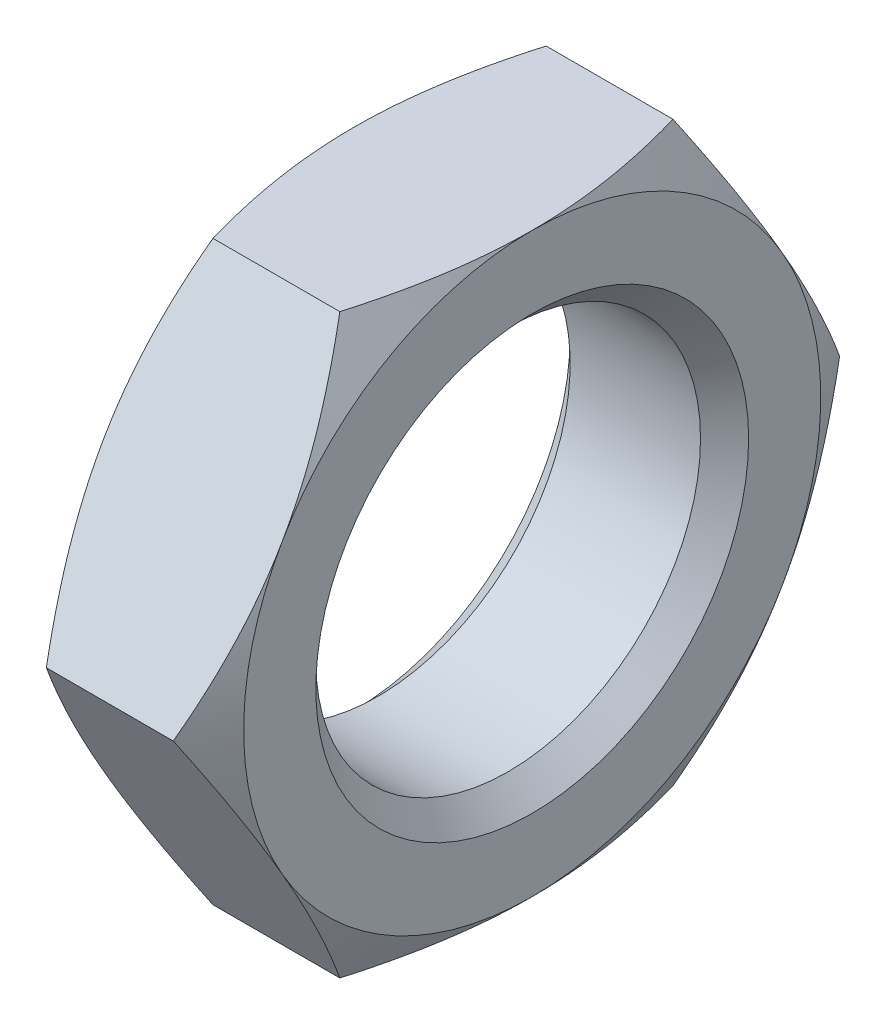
ISO-10303-21;
HEADER;
FILE_DESCRIPTION(('STEP AP214'),'2;1');
FILE_NAME('part.step','',(''),(''),'','','');
FILE_SCHEMA(('AUTOMOTIVE_DESIGN { 1 0 10303 214 1 1 1 1 }'));
ENDSEC;
DATA;
#1=APPLICATION_CONTEXT('core data for automotive mechanical design processes');
#2=APPLICATION_PROTOCOL_DEFINITION('international standard','automotive_design',2000,#1);
#3=PRODUCT_CONTEXT('',#1,'mechanical');
#4=PRODUCT('Part','Part','',(#3));
#5=PRODUCT_RELATED_PRODUCT_CATEGORY('part','',(#4));
#6=PRODUCT_DEFINITION_FORMATION('','',#4);
#7=PRODUCT_DEFINITION_CONTEXT('part definition',#1,'design');
#8=PRODUCT_DEFINITION('design','',#6,#7);
#9=PRODUCT_DEFINITION_SHAPE('','',#8);
#10=(LENGTH_UNIT() NAMED_UNIT(*) SI_UNIT(.MILLI.,.METRE.));
#11=(NAMED_UNIT(*) PLANE_ANGLE_UNIT() SI_UNIT($,.RADIAN.));
#12=(NAMED_UNIT(*) SI_UNIT($,.STERADIAN.) SOLID_ANGLE_UNIT());
#13=UNCERTAINTY_MEASURE_WITH_UNIT(LENGTH_MEASURE(1.E-05),#10,'distance_accuracy_value','');
#14=(GEOMETRIC_REPRESENTATION_CONTEXT(3) GLOBAL_UNCERTAINTY_ASSIGNED_CONTEXT((#13)) GLOBAL_UNIT_ASSIGNED_CONTEXT((#10,
#11,#12)) REPRESENTATION_CONTEXT('',''));
#15=CARTESIAN_POINT('',(0.,0.,0.));
#16=DIRECTION('',(0.,0.,1.));
#17=DIRECTION('',(1.,0.,0.));
#18=AXIS2_PLACEMENT_3D('',#15,#16,#17);
#19=CARTESIAN_POINT('',(7.42,12.,-6.92820323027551));
#20=DIRECTION('',(1.,0.,0.));
#21=DIRECTION('',(0.,0.,-1.));
#22=AXIS2_PLACEMENT_3D('',#19,#20,#21);
#23=PLANE('',#22);
#24=CARTESIAN_POINT('',(7.42,0.,0.));
#25=DIRECTION('',(1.,0.,0.));
#26=DIRECTION('',(0.,0.,-1.));
#27=AXIS2_PLACEMENT_3D('',#24,#25,#26);
#28=CIRCLE('',#27,9.00000000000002);
#29=CARTESIAN_POINT('',(7.42,0.,-9.00000000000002));
#30=VERTEX_POINT('',#29);
#31=EDGE_CURVE('E11',#30,#30,#28,.F.);
#32=ORIENTED_EDGE('',*,*,#31,.T.);
#33=EDGE_LOOP('',(#32));
#34=FACE_BOUND('',#33,.T.);
#35=CARTESIAN_POINT('',(7.42,0.,0.));
#36=DIRECTION('',(1.,0.,0.));
#37=DIRECTION('',(0.,0.,-1.));
#38=AXIS2_PLACEMENT_3D('',#35,#36,#37);
#39=CIRCLE('',#38,12.);
#40=CARTESIAN_POINT('',(7.42,-12.,0.));
#41=VERTEX_POINT('',#40);
#42=CARTESIAN_POINT('',(7.42,-6.,-10.3923048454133));
#43=VERTEX_POINT('',#42);
#44=EDGE_CURVE('E142',#41,#43,#39,.T.);
#45=ORIENTED_EDGE('',*,*,#44,.T.);
#46=CARTESIAN_POINT('',(7.42,6.,-10.3923048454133));
#47=VERTEX_POINT('',#46);
#48=EDGE_CURVE('E130',#43,#47,#39,.T.);
#49=ORIENTED_EDGE('',*,*,#48,.T.);
#50=CARTESIAN_POINT('',(7.42,12.,0.));
#51=VERTEX_POINT('',#50);
#52=EDGE_CURVE('E144',#47,#51,#39,.T.);
#53=ORIENTED_EDGE('',*,*,#52,.T.);
#54=CARTESIAN_POINT('',(7.42,6.,10.3923048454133));
#55=VERTEX_POINT('',#54);
#56=EDGE_CURVE('E55',#51,#55,#39,.T.);
#57=ORIENTED_EDGE('',*,*,#56,.T.);
#58=CARTESIAN_POINT('',(7.42,-6.,10.3923048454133));
#59=VERTEX_POINT('',#58);
#60=EDGE_CURVE('E63',#55,#59,#39,.T.);
#61=ORIENTED_EDGE('',*,*,#60,.T.);
#62=EDGE_CURVE('E166',#59,#41,#39,.T.);
#63=ORIENTED_EDGE('',*,*,#62,.T.);
#64=EDGE_LOOP('',(#45,#49,#53,#57,#61,#63));
#65=FACE_BOUND('',#64,.T.);
#66=ADVANCED_FACE('F39',(#34,#65),#23,.T.);
#67=CARTESIAN_POINT('',(0.,12.,-6.92820323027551));
#68=DIRECTION('',(1.,0.,0.));
#69=DIRECTION('',(0.,0.,-1.));
#70=AXIS2_PLACEMENT_3D('',#67,#68,#69);
#71=PLANE('',#70);
#72=CARTESIAN_POINT('',(0.,0.,0.));
#73=DIRECTION('',(1.,0.,0.));
#74=DIRECTION('',(0.,0.,-1.));
#75=AXIS2_PLACEMENT_3D('',#72,#73,#74);
#76=CIRCLE('',#75,8.99999999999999);
#77=CARTESIAN_POINT('',(0.,0.,-8.99999999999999));
#78=VERTEX_POINT('',#77);
#79=EDGE_CURVE('E164',#78,#78,#76,.T.);
#80=ORIENTED_EDGE('',*,*,#79,.T.);
#81=EDGE_LOOP('',(#80));
#82=FACE_BOUND('',#81,.T.);
#83=CARTESIAN_POINT('',(0.,0.,0.));
#84=DIRECTION('',(1.,0.,0.));
#85=DIRECTION('',(0.,0.,-1.));
#86=AXIS2_PLACEMENT_3D('',#83,#84,#85);
#87=CIRCLE('',#86,12.);
#88=CARTESIAN_POINT('',(0.,-6.,-10.3923048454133));
#89=VERTEX_POINT('',#88);
#90=CARTESIAN_POINT('',(0.,6.,-10.3923048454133));
#91=VERTEX_POINT('',#90);
#92=EDGE_CURVE('E173',#89,#91,#87,.T.);
#93=ORIENTED_EDGE('',*,*,#92,.F.);
#94=CARTESIAN_POINT('',(0.,-12.,0.));
#95=VERTEX_POINT('',#94);
#96=EDGE_CURVE('E319',#95,#89,#87,.T.);
#97=ORIENTED_EDGE('',*,*,#96,.F.);
#98=CARTESIAN_POINT('',(0.,-6.,10.3923048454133));
#99=VERTEX_POINT('',#98);
#100=EDGE_CURVE('E322',#99,#95,#87,.T.);
#101=ORIENTED_EDGE('',*,*,#100,.F.);
#102=CARTESIAN_POINT('',(0.,6.,10.3923048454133));
#103=VERTEX_POINT('',#102);
#104=EDGE_CURVE('E329',#103,#99,#87,.T.);
#105=ORIENTED_EDGE('',*,*,#104,.F.);
#106=CARTESIAN_POINT('',(0.,12.,0.));
#107=VERTEX_POINT('',#106);
#108=EDGE_CURVE('E178',#107,#103,#87,.T.);
#109=ORIENTED_EDGE('',*,*,#108,.F.);
#110=EDGE_CURVE('E174',#91,#107,#87,.T.);
#111=ORIENTED_EDGE('',*,*,#110,.F.);
#112=EDGE_LOOP('',(#93,#97,#101,#105,#109,#111));
#113=FACE_BOUND('',#112,.T.);
#114=ADVANCED_FACE('F320',(#82,#113),#71,.F.);
#115=CARTESIAN_POINT('',(7.42,0.,0.));
#116=DIRECTION('',(-1.,0.,0.));
#117=DIRECTION('',(0.,0.,1.));
#118=AXIS2_PLACEMENT_3D('',#115,#116,#117);
#119=CYLINDRICAL_SURFACE('',#118,8.);
#120=CARTESIAN_POINT('',(0.999999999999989,0.,0.));
#121=DIRECTION('',(1.,0.,0.));
#122=DIRECTION('',(0.,0.,-1.));
#123=AXIS2_PLACEMENT_3D('',#120,#121,#122);
#124=CIRCLE('',#123,8.);
#125=CARTESIAN_POINT('',(0.999999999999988,0.,8.));
#126=VERTEX_POINT('',#125);
#127=EDGE_CURVE('E48',#126,#126,#124,.F.);
#128=CARTESIAN_POINT('',(6.41999999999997,0.,0.));
#129=DIRECTION('',(1.,0.,0.));
#130=DIRECTION('',(0.,0.,-1.));
#131=AXIS2_PLACEMENT_3D('',#128,#129,#130);
#132=CIRCLE('',#131,8.);
#133=CARTESIAN_POINT('',(6.41999999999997,0.,8.));
#134=VERTEX_POINT('',#133);
#135=EDGE_CURVE('E386',#134,#134,#132,.T.);
#136=CARTESIAN_POINT('',(0.999999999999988,0.,8.));
#137=CARTESIAN_POINT('',(1.05645833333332,0.,8.));
#138=CARTESIAN_POINT('',(1.11291666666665,0.,8.));
#139=CARTESIAN_POINT('',(1.22583333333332,0.,8.));
#140=CARTESIAN_POINT('',(1.28229166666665,0.,8.));
#141=CARTESIAN_POINT('',(1.39520833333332,0.,8.));
#142=CARTESIAN_POINT('',(1.45166666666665,0.,8.));
#143=CARTESIAN_POINT('',(1.56458333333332,0.,8.));
#144=CARTESIAN_POINT('',(1.62104166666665,0.,8.));
#145=CARTESIAN_POINT('',(1.73395833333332,0.,8.));
#146=CARTESIAN_POINT('',(1.79041666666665,0.,8.));
#147=CARTESIAN_POINT('',(1.90333333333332,0.,8.));
#148=CARTESIAN_POINT('',(1.95979166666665,0.,8.));
#149=CARTESIAN_POINT('',(2.07270833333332,0.,8.));
#150=CARTESIAN_POINT('',(2.12916666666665,0.,8.));
#151=CARTESIAN_POINT('',(2.24208333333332,0.,8.));
#152=CARTESIAN_POINT('',(2.29854166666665,0.,8.));
#153=CARTESIAN_POINT('',(2.41145833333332,0.,8.));
#154=CARTESIAN_POINT('',(2.46791666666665,0.,8.));
#155=CARTESIAN_POINT('',(2.58083333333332,0.,8.));
#156=CARTESIAN_POINT('',(2.63729166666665,0.,8.));
#157=CARTESIAN_POINT('',(2.75020833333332,0.,8.));
#158=CARTESIAN_POINT('',(2.80666666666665,0.,8.));
#159=CARTESIAN_POINT('',(2.91958333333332,0.,8.));
#160=CARTESIAN_POINT('',(2.97604166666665,0.,8.));
#161=CARTESIAN_POINT('',(3.08895833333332,0.,8.));
#162=CARTESIAN_POINT('',(3.14541666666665,0.,8.));
#163=CARTESIAN_POINT('',(3.25833333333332,0.,8.));
#164=CARTESIAN_POINT('',(3.31479166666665,0.,8.));
#165=CARTESIAN_POINT('',(3.42770833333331,0.,8.));
#166=CARTESIAN_POINT('',(3.48416666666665,0.,8.));
#167=CARTESIAN_POINT('',(3.59708333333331,0.,8.));
#168=CARTESIAN_POINT('',(3.65354166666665,0.,8.));
#169=CARTESIAN_POINT('',(3.76645833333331,0.,8.));
#170=CARTESIAN_POINT('',(3.82291666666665,0.,8.));
#171=CARTESIAN_POINT('',(3.93583333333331,0.,8.));
#172=CARTESIAN_POINT('',(3.99229166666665,0.,8.));
#173=CARTESIAN_POINT('',(4.10520833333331,0.,8.));
#174=CARTESIAN_POINT('',(4.16166666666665,0.,8.));
#175=CARTESIAN_POINT('',(4.27458333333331,0.,8.));
#176=CARTESIAN_POINT('',(4.33104166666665,0.,8.));
#177=CARTESIAN_POINT('',(4.44395833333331,0.,8.));
#178=CARTESIAN_POINT('',(4.50041666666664,0.,8.));
#179=CARTESIAN_POINT('',(4.61333333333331,0.,8.));
#180=CARTESIAN_POINT('',(4.66979166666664,0.,8.));
#181=CARTESIAN_POINT('',(4.78270833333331,0.,8.));
#182=CARTESIAN_POINT('',(4.83916666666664,0.,8.));
#183=CARTESIAN_POINT('',(4.95208333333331,0.,8.));
#184=CARTESIAN_POINT('',(5.00854166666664,0.,8.));
#185=CARTESIAN_POINT('',(5.12145833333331,0.,8.));
#186=CARTESIAN_POINT('',(5.17791666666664,0.,8.));
#187=CARTESIAN_POINT('',(5.29083333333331,0.,8.));
#188=CARTESIAN_POINT('',(5.34729166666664,0.,8.));
#189=CARTESIAN_POINT('',(5.46020833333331,0.,8.));
#190=CARTESIAN_POINT('',(5.51666666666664,0.,8.));
#191=CARTESIAN_POINT('',(5.62958333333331,0.,8.));
#192=CARTESIAN_POINT('',(5.68604166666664,0.,8.));
#193=CARTESIAN_POINT('',(5.79895833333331,0.,8.));
#194=CARTESIAN_POINT('',(5.85541666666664,0.,8.));
#195=CARTESIAN_POINT('',(5.96833333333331,0.,8.));
#196=CARTESIAN_POINT('',(6.02479166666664,0.,8.));
#197=CARTESIAN_POINT('',(6.13770833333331,0.,8.));
#198=CARTESIAN_POINT('',(6.19416666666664,0.,8.));
#199=CARTESIAN_POINT('',(6.30708333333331,0.,8.));
#200=CARTESIAN_POINT('',(6.36354166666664,0.,8.));
#201=CARTESIAN_POINT('',(6.41999999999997,0.,8.));
#202=B_SPLINE_CURVE_WITH_KNOTS('',3,(#136,#137,#138,#139,#140,#141,#142,#143,#144,#145,#146,
#147,#148,#149,#150,#151,#152,#153,#154,#155,#156,#157,#158,#159,#160,#161,#162,#163,#164,#165,
#166,#167,#168,#169,#170,#171,#172,#173,#174,#175,#176,#177,#178,#179,#180,#181,#182,#183,#184,
#185,#186,#187,#188,#189,#190,#191,#192,#193,#194,#195,#196,#197,#198,#199,#200,#201),
.UNSPECIFIED.,.F.,.F.,(4,2,2,2,2,2,2,2,2,2,2,2,2,2,2,2,2,2,2,2,2,2,2,2,2,2,2,2,2,2,2,2,4),(0.,
0.169374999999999,0.338749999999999,0.508124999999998,0.677499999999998,0.846874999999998,
1.01625,1.185625,1.355,1.524375,1.69375,1.863125,2.03249999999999,2.20187499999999,
2.37124999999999,2.54062499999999,2.70999999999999,2.87937499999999,3.04874999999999,
3.21812499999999,3.38749999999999,3.55687499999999,3.72624999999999,3.89562499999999,
4.06499999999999,4.23437499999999,4.40374999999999,4.57312499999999,4.74249999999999,
4.91187499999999,5.08124999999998,5.25062499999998,5.41999999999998),.UNSPECIFIED.);
#203=EDGE_CURVE('BSEAM234',#126,#134,#202,.T.);
#204=ORIENTED_EDGE('',*,*,#127,.T.);
#205=ORIENTED_EDGE('',*,*,#135,.T.);
#206=ORIENTED_EDGE('',*,*,#203,.T.);
#207=ORIENTED_EDGE('',*,*,#203,.F.);
#208=EDGE_LOOP('',(#204,#206,#205,#207));
#209=FACE_BOUND('',#208,.T.);
#210=ADVANCED_FACE('F234',(#209),#119,.F.);
#211=CARTESIAN_POINT('',(0.,0.,0.));
#212=DIRECTION('',(1.,0.,0.));
#213=DIRECTION('',(0.,0.,-1.));
#214=AXIS2_PLACEMENT_3D('',#211,#212,#213);
#215=CONICAL_SURFACE('',#214,12.,1.0471975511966);
#216=CARTESIAN_POINT('',(1.07186343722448,-12.0002,-6.92808776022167));
#217=CARTESIAN_POINT('',(0.983949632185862,-11.7364142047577,-7.08038456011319));
#218=CARTESIAN_POINT('',(0.900025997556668,-11.4716448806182,-7.23324920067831));
#219=CARTESIAN_POINT('',(0.741266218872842,-10.9399829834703,-7.54020434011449));
#220=CARTESIAN_POINT('',(0.666433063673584,-10.6730897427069,-7.69429522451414));
#221=CARTESIAN_POINT('',(0.457017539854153,-9.86810959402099,-8.15905073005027));
#222=CARTESIAN_POINT('',(0.337903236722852,-9.3268449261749,-8.47155003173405));
#223=CARTESIAN_POINT('',(0.198231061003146,-8.516867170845,-8.93919090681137));
#224=CARTESIAN_POINT('',(0.158443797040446,-8.25057389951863,-9.09293539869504));
#225=CARTESIAN_POINT('',(0.0917233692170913,-7.71675440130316,-9.40113622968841));
#226=CARTESIAN_POINT('',(0.0647904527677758,-7.44922815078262,-9.55559258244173));
#227=CARTESIAN_POINT('',(0.0244685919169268,-6.91372963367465,-9.86476279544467));
#228=CARTESIAN_POINT('',(0.0110635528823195,-6.64575827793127,-10.0194761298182));
#229=CARTESIAN_POINT('',(-0.00191690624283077,-6.10956726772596,-10.3290461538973));
#230=CARTESIAN_POINT('',(-0.00149275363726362,-5.84134762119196,-10.4839028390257));
#231=CARTESIAN_POINT('',(0.0122200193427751,-5.33991062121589,-10.7734076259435));
#232=CARTESIAN_POINT('',(0.0238359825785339,-5.10665750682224,-10.908076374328));
#233=CARTESIAN_POINT('',(0.0573080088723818,-4.64068775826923,-11.1771041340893));
#234=CARTESIAN_POINT('',(0.0791647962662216,-4.40797116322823,-11.3114631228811));
#235=CARTESIAN_POINT('',(0.132737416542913,-3.94320092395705,-11.5797983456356));
#236=CARTESIAN_POINT('',(0.164461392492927,-3.711147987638,-11.7137741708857));
#237=CARTESIAN_POINT('',(0.237211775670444,-3.24813003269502,-11.9810977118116));
#238=CARTESIAN_POINT('',(0.278238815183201,-3.01716508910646,-12.1144453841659));
#239=CARTESIAN_POINT('',(0.416311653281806,-2.31605804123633,-12.5192297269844));
#240=CARTESIAN_POINT('',(0.52712488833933,-1.84794625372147,-12.789494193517));
#241=CARTESIAN_POINT('',(0.778625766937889,-0.918702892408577,-13.3259930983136));
#242=CARTESIAN_POINT('',(0.919254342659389,-0.457559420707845,-13.5922344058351));
#243=CARTESIAN_POINT('',(1.07186343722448,0.000199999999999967,-13.8565219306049));
#244=B_SPLINE_CURVE_WITH_KNOTS('',3,(#216,#217,#218,#219,#220,#221,#222,#223,#224,#225,#226,
#227,#228,#229,#230,#231,#232,#233,#234,#235,#236,#237,#238,#239,#240,#241,#242,#243),
.UNSPECIFIED.,.F.,.F.,(4,2,2,2,2,2,2,2,2,2,2,2,2,4),(0.,0.951004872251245,1.90232158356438,
3.80900466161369,4.7389455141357,5.66890426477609,6.59775529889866,7.5265776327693,
8.33514643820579,9.14377244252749,9.95306755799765,10.7624176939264,12.4167102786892,
14.0677556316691),.UNSPECIFIED.);
#245=CARTESIAN_POINT('',(1.07179676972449,0.,-13.856406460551));
#246=VERTEX_POINT('',#245);
#247=EDGE_CURVE('E336',#89,#246,#244,.T.);
#248=ORIENTED_EDGE('',*,*,#247,.F.);
#249=ORIENTED_EDGE('',*,*,#92,.T.);
#250=CARTESIAN_POINT('',(1.07186343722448,-0.000200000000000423,-13.8565219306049));
#251=CARTESIAN_POINT('',(0.983949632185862,0.263585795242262,-13.7042251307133));
#252=CARTESIAN_POINT('',(0.900025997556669,0.528355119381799,-13.5513604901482));
#253=CARTESIAN_POINT('',(0.741266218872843,1.06001701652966,-13.244405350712));
#254=CARTESIAN_POINT('',(0.666433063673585,1.32691025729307,-13.0903144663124));
#255=CARTESIAN_POINT('',(0.457017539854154,2.13189040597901,-12.6255589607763));
#256=CARTESIAN_POINT('',(0.337903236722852,2.6731550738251,-12.3130596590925));
#257=CARTESIAN_POINT('',(0.198231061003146,3.483132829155,-11.8454187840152));
#258=CARTESIAN_POINT('',(0.158443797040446,3.74942610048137,-11.6916742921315));
#259=CARTESIAN_POINT('',(0.0917233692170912,4.28324559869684,-11.3834734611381));
#260=CARTESIAN_POINT('',(0.0647904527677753,4.55077184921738,-11.2290171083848));
#261=CARTESIAN_POINT('',(0.0244685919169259,5.08627036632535,-10.9198468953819));
#262=CARTESIAN_POINT('',(0.0110635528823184,5.35424172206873,-10.7651335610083));
#263=CARTESIAN_POINT('',(-0.00191690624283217,5.89043273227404,-10.4555635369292));
#264=CARTESIAN_POINT('',(-0.00149275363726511,6.15865237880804,-10.3007068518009));
#265=CARTESIAN_POINT('',(0.0122200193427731,6.6600893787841,-10.011202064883));
#266=CARTESIAN_POINT('',(0.0238359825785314,6.89334249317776,-9.87653331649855));
#267=CARTESIAN_POINT('',(0.0573080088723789,7.35931224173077,-9.60750555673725));
#268=CARTESIAN_POINT('',(0.0791647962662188,7.59202883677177,-9.47314656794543));
#269=CARTESIAN_POINT('',(0.132737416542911,8.05679907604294,-9.20481134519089));
#270=CARTESIAN_POINT('',(0.164461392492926,8.288852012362,-9.07083551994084));
#271=CARTESIAN_POINT('',(0.237211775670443,8.75186996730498,-8.80351197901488));
#272=CARTESIAN_POINT('',(0.2782388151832,8.98283491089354,-8.67016430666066));
#273=CARTESIAN_POINT('',(0.416311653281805,9.68394195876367,-8.2653799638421));
#274=CARTESIAN_POINT('',(0.527124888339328,10.1520537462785,-7.99511549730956));
#275=CARTESIAN_POINT('',(0.778625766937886,11.0812971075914,-7.45861659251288));
#276=CARTESIAN_POINT('',(0.919254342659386,11.5424405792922,-7.19237528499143));
#277=CARTESIAN_POINT('',(1.07186343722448,12.0002,-6.92808776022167));
#278=B_SPLINE_CURVE_WITH_KNOTS('',3,(#250,#251,#252,#253,#254,#255,#256,#257,#258,#259,#260,
#261,#262,#263,#264,#265,#266,#267,#268,#269,#270,#271,#272,#273,#274,#275,#276,#277),
.UNSPECIFIED.,.F.,.F.,(4,2,2,2,2,2,2,2,2,2,2,2,2,4),(0.,0.951004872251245,1.90232158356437,
3.80900466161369,4.7389455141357,5.6689042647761,6.59775529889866,7.52657763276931,
8.33514643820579,9.1437724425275,9.95306755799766,10.7624176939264,12.4167102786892,
14.0677556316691),.UNSPECIFIED.);
#279=EDGE_CURVE('E215',#246,#91,#278,.T.);
#280=ORIENTED_EDGE('',*,*,#279,.F.);
#281=EDGE_LOOP('',(#248,#249,#280));
#282=FACE_BOUND('',#281,.T.);
#283=ADVANCED_FACE('F194',(#282),#215,.T.);
#284=ORIENTED_EDGE('',*,*,#96,.T.);
#285=CARTESIAN_POINT('',(1.07179676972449,-12.,-6.92820323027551));
#286=VERTEX_POINT('',#285);
#287=EDGE_CURVE('E156',#286,#89,#244,.T.);
#288=ORIENTED_EDGE('',*,*,#287,.F.);
#289=CARTESIAN_POINT('',(5.92095544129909,-12.,-18.7430690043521));
#290=CARTESIAN_POINT('',(5.79326861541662,-12.,-18.480459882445));
#291=CARTESIAN_POINT('',(5.6662085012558,-12.,-18.2175461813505));
#292=CARTESIAN_POINT('',(5.41348337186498,-12.,-17.6910461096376));
#293=CARTESIAN_POINT('',(5.28781837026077,-12.,-17.4274597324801));
#294=CARTESIAN_POINT('',(4.91309628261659,-12.,-16.6355279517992));
#295=CARTESIAN_POINT('',(4.66634899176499,-12.,-16.1060855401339));
#296=CARTESIAN_POINT('',(4.17918059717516,-12.,-15.0408838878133));
#297=CARTESIAN_POINT('',(3.93880010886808,-12.,-14.5051060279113));
#298=CARTESIAN_POINT('',(3.46769578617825,-12.,-13.4293359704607));
#299=CARTESIAN_POINT('',(3.2369715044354,-12.,-12.8893439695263));
#300=CARTESIAN_POINT('',(2.78029356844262,-12.,-11.7863247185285));
#301=CARTESIAN_POINT('',(2.55475054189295,-12.,-11.2231265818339));
#302=CARTESIAN_POINT('',(2.12041351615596,-12.,-10.0901865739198));
#303=CARTESIAN_POINT('',(1.91162137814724,-12.,-9.52044398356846));
#304=CARTESIAN_POINT('',(1.51617350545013,-12.,-8.37455109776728));
#305=CARTESIAN_POINT('',(1.32947407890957,-12.,-7.79841600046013));
#306=CARTESIAN_POINT('',(0.984103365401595,-12.,-6.63782792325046));
#307=CARTESIAN_POINT('',(0.825423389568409,-12.,-6.05337758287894));
#308=CARTESIAN_POINT('',(0.614531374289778,-12.,-5.17198345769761));
#309=CARTESIAN_POINT('',(0.548902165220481,-12.,-4.87823142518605));
#310=CARTESIAN_POINT('',(0.427454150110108,-12.,-4.28869579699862));
#311=CARTESIAN_POINT('',(0.37163514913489,-12.,-3.9929122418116));
#312=CARTESIAN_POINT('',(0.270784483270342,-12.,-3.39950781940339));
#313=CARTESIAN_POINT('',(0.22575262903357,-12.,-3.10188698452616));
#314=CARTESIAN_POINT('',(0.147369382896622,-12.,-2.5051123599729));
#315=CARTESIAN_POINT('',(0.11401752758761,-12.,-2.20595863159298));
#316=CARTESIAN_POINT('',(0.0600825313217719,-12.,-1.61049985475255));
#317=CARTESIAN_POINT('',(0.0393357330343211,-12.,-1.31420972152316));
#318=CARTESIAN_POINT('',(0.010397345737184,-12.,-0.7210177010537));
#319=CARTESIAN_POINT('',(0.00220554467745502,-12.,-0.424115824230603));
#320=CARTESIAN_POINT('',(-0.001427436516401,-12.,0.169768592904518));
#321=CARTESIAN_POINT('',(0.00313140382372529,-12.,0.466751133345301));
#322=CARTESIAN_POINT('',(0.0248868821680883,-12.,1.0602562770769));
#323=CARTESIAN_POINT('',(0.0420840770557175,-12.,1.35677885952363));
#324=CARTESIAN_POINT('',(0.0979167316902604,-12.,2.06542585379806));
#325=CARTESIAN_POINT('',(0.142326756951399,-12.,2.47710358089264));
#326=CARTESIAN_POINT('',(0.253120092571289,-12.,3.29749323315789));
#327=CARTESIAN_POINT('',(0.319506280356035,-12.,3.70620476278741));
#328=CARTESIAN_POINT('',(0.47189057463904,-12.,4.52024198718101));
#329=CARTESIAN_POINT('',(0.557903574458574,-12.,4.92556486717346));
#330=CARTESIAN_POINT('',(0.746909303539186,-12.,5.73218890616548));
#331=CARTESIAN_POINT('',(0.849901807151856,-12.,6.13349011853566));
#332=CARTESIAN_POINT('',(1.07280897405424,-12.,6.94097681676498));
#333=CARTESIAN_POINT('',(1.1930498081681,-12.,7.34707163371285));
#334=CARTESIAN_POINT('',(1.44622371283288,-12.,8.15526284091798));
#335=CARTESIAN_POINT('',(1.57915686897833,-12.,8.55735920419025));
#336=CARTESIAN_POINT('',(1.85558131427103,-12.,9.35774753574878));
#337=CARTESIAN_POINT('',(1.99906927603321,-12.,9.75604065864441));
#338=CARTESIAN_POINT('',(2.29488895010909,-12.,10.5493087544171));
#339=CARTESIAN_POINT('',(2.44722054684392,-12.,10.9442837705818));
#340=CARTESIAN_POINT('',(2.82336904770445,-12.,11.8929641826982));
#341=CARTESIAN_POINT('',(3.05084381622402,-12.,12.4452172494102));
#342=CARTESIAN_POINT('',(3.51728088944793,-12.,13.5448658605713));
#343=CARTESIAN_POINT('',(3.75624398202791,-12.,14.0922610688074));
#344=CARTESIAN_POINT('',(4.24330362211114,-12.,15.1831242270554));
#345=CARTESIAN_POINT('',(4.49140241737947,-12.,15.7265911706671));
#346=CARTESIAN_POINT('',(4.99484515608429,-12.,16.8101341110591));
#347=CARTESIAN_POINT('',(5.25018892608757,-12.,17.350210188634));
#348=CARTESIAN_POINT('',(5.76704128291,-12.,18.4281827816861));
#349=CARTESIAN_POINT('',(6.02855678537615,-12.,18.9660759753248));
#350=CARTESIAN_POINT('',(6.55638761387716,-12.,20.0395019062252));
#351=CARTESIAN_POINT('',(6.8227029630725,-12.,20.5750346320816));
#352=CARTESIAN_POINT('',(7.35925561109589,-12.,21.6440338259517));
#353=CARTESIAN_POINT('',(7.62949234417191,-12.,22.1775005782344));
#354=CARTESIAN_POINT('',(8.17327057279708,-12.,23.2427480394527));
#355=CARTESIAN_POINT('',(8.44681208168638,-12.,23.7745287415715));
#356=CARTESIAN_POINT('',(9.22378174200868,-12.,25.2753799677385));
#357=CARTESIAN_POINT('',(9.73043925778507,-12.,26.2427786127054));
#358=CARTESIAN_POINT('',(10.750619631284,-12.,28.1739888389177));
#359=CARTESIAN_POINT('',(11.2641427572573,-12.,29.137800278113));
#360=CARTESIAN_POINT('',(12.2950541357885,-12.,31.0600578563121));
#361=CARTESIAN_POINT('',(12.8124285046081,-12.,32.0185114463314));
#362=CARTESIAN_POINT('',(13.5915227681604,-12.,33.454508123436));
#363=CARTESIAN_POINT('',(13.8517187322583,-12.,33.9328792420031));
#364=CARTESIAN_POINT('',(14.3730197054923,-12.,34.8891249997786));
#365=CARTESIAN_POINT('',(14.6341247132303,-12.,35.366999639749));
#366=CARTESIAN_POINT('',(14.895631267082,-12.,35.8446545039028));
#367=B_SPLINE_CURVE_WITH_KNOTS('',3,(#289,#290,#291,#292,#293,#294,#295,#296,#297,#298,#299,
#300,#301,#302,#303,#304,#305,#306,#307,#308,#309,#310,#311,#312,#313,#314,#315,#316,#317,#318,
#319,#320,#321,#322,#323,#324,#325,#326,#327,#328,#329,#330,#331,#332,#333,#334,#335,#336,#337,
#338,#339,#340,#341,#342,#343,#344,#345,#346,#347,#348,#349,#350,#351,#352,#353,#354,#355,#356,
#357,#358,#359,#360,#361,#362,#363,#364,#365,#366),.UNSPECIFIED.,.F.,.F.,(4,2,2,2,2,2,2,2,2,2,2,
2,2,2,2,2,2,2,2,2,2,2,2,2,2,2,2,2,2,2,2,2,2,2,2,2,2,2,4),(0.,0.876016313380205,1.75204117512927,
3.50434334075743,5.26596316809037,7.02750129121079,8.84734071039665,10.6673820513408,
12.4837615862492,14.2995768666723,15.2024218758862,16.1052489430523,17.0080601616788,
17.9108355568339,18.8016243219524,19.6923980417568,20.5831731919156,21.4739875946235,
22.7155021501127,23.9571793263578,25.1998018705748,26.4424079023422,27.7127264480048,
28.9830535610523,30.2529819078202,31.522893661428,33.3145166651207,35.10626271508,
36.8984525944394,38.6905996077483,40.4848602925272,42.2791296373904,44.0731426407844,
45.8671628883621,49.1432555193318,52.4194765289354,55.6869981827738,57.3206644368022,
58.9543281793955),.UNSPECIFIED.);
#368=EDGE_CURVE('E177',#95,#286,#367,.F.);
#369=ORIENTED_EDGE('',*,*,#368,.F.);
#370=EDGE_LOOP('',(#284,#288,#369));
#371=FACE_BOUND('',#370,.T.);
#372=ADVANCED_FACE('F351',(#371),#215,.T.);
#373=CARTESIAN_POINT('',(3.71,0.,0.));
#374=DIRECTION('',(-1.,0.,0.));
#375=DIRECTION('',(0.,0.,1.));
#376=AXIS2_PLACEMENT_3D('',#373,#374,#375);
#377=CONICAL_SURFACE('',#376,18.4259084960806,1.0471975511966);
#378=CARTESIAN_POINT('',(6.34813656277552,0.000199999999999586,-13.8565219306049));
#379=CARTESIAN_POINT('',(6.43605036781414,-0.263585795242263,-13.7042251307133));
#380=CARTESIAN_POINT('',(6.51997400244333,-0.528355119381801,-13.5513604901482));
#381=CARTESIAN_POINT('',(6.67873378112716,-1.06001701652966,-13.244405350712));
#382=CARTESIAN_POINT('',(6.75356693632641,-1.32691025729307,-13.0903144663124));
#383=CARTESIAN_POINT('',(6.96298246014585,-2.13189040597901,-12.6255589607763));
#384=CARTESIAN_POINT('',(7.08209676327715,-2.6731550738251,-12.3130596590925));
#385=CARTESIAN_POINT('',(7.22176893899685,-3.483132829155,-11.8454187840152));
#386=CARTESIAN_POINT('',(7.26155620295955,-3.74942610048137,-11.6916742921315));
#387=CARTESIAN_POINT('',(7.32827663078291,-4.28324559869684,-11.3834734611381));
#388=CARTESIAN_POINT('',(7.35520954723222,-4.55077184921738,-11.2290171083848));
#389=CARTESIAN_POINT('',(7.39553140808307,-5.08627036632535,-10.9198468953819));
#390=CARTESIAN_POINT('',(7.40893644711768,-5.35424172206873,-10.7651335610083));
#391=CARTESIAN_POINT('',(7.42191690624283,-5.89043273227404,-10.4555635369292));
#392=CARTESIAN_POINT('',(7.42149275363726,-6.15865237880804,-10.3007068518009));
#393=CARTESIAN_POINT('',(7.40777998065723,-6.66008937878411,-10.011202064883));
#394=CARTESIAN_POINT('',(7.39616401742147,-6.89334249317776,-9.87653331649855));
#395=CARTESIAN_POINT('',(7.36269199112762,-7.35931224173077,-9.60750555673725));
#396=CARTESIAN_POINT('',(7.34083520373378,-7.59202883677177,-9.47314656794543));
#397=CARTESIAN_POINT('',(7.28726258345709,-8.05679907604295,-9.20481134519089));
#398=CARTESIAN_POINT('',(7.25553860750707,-8.28885201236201,-9.07083551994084));
#399=CARTESIAN_POINT('',(7.18278822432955,-8.75186996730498,-8.80351197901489));
#400=CARTESIAN_POINT('',(7.1417611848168,-8.98283491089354,-8.67016430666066));
#401=CARTESIAN_POINT('',(7.00368834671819,-9.68394195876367,-8.2653799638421));
#402=CARTESIAN_POINT('',(6.89287511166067,-10.1520537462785,-7.99511549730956));
#403=CARTESIAN_POINT('',(6.64137423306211,-11.0812971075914,-7.45861659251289));
#404=CARTESIAN_POINT('',(6.50074565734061,-11.5424405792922,-7.19237528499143));
#405=CARTESIAN_POINT('',(6.34813656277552,-12.0002,-6.92808776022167));
#406=B_SPLINE_CURVE_WITH_KNOTS('',3,(#378,#379,#380,#381,#382,#383,#384,#385,#386,#387,#388,
#389,#390,#391,#392,#393,#394,#395,#396,#397,#398,#399,#400,#401,#402,#403,#404,#405),
.UNSPECIFIED.,.F.,.F.,(4,2,2,2,2,2,2,2,2,2,2,2,2,4),(0.,0.951004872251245,1.90232158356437,
3.80900466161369,4.7389455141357,5.66890426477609,6.59775529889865,7.5265776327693,
8.33514643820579,9.14377244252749,9.95306755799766,10.7624176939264,12.4167102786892,
14.0677556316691),.UNSPECIFIED.);
#407=CARTESIAN_POINT('',(6.34820323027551,-12.,-6.92820323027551));
#408=VERTEX_POINT('',#407);
#409=EDGE_CURVE('E147',#43,#408,#406,.T.);
#410=ORIENTED_EDGE('',*,*,#409,.F.);
#411=ORIENTED_EDGE('',*,*,#44,.F.);
#412=CARTESIAN_POINT('',(1.49904455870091,-12.,-18.7430690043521));
#413=CARTESIAN_POINT('',(1.62673138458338,-12.,-18.480459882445));
#414=CARTESIAN_POINT('',(1.7537914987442,-12.,-18.2175461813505));
#415=CARTESIAN_POINT('',(2.00651662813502,-12.,-17.6910461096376));
#416=CARTESIAN_POINT('',(2.13218162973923,-12.,-17.4274597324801));
#417=CARTESIAN_POINT('',(2.50690371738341,-12.,-16.6355279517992));
#418=CARTESIAN_POINT('',(2.753651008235,-12.,-16.1060855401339));
#419=CARTESIAN_POINT('',(3.24081940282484,-12.,-15.0408838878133));
#420=CARTESIAN_POINT('',(3.48119989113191,-12.,-14.5051060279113));
#421=CARTESIAN_POINT('',(3.95230421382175,-12.,-13.4293359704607));
#422=CARTESIAN_POINT('',(4.1830284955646,-12.,-12.8893439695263));
#423=CARTESIAN_POINT('',(4.63970643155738,-12.,-11.7863247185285));
#424=CARTESIAN_POINT('',(4.86524945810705,-12.,-11.2231265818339));
#425=CARTESIAN_POINT('',(5.29958648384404,-12.,-10.0901865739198));
#426=CARTESIAN_POINT('',(5.50837862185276,-12.,-9.52044398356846));
#427=CARTESIAN_POINT('',(5.90382649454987,-12.,-8.37455109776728));
#428=CARTESIAN_POINT('',(6.09052592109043,-12.,-7.79841600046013));
#429=CARTESIAN_POINT('',(6.4358966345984,-12.,-6.63782792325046));
#430=CARTESIAN_POINT('',(6.59457661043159,-12.,-6.05337758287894));
#431=CARTESIAN_POINT('',(6.80546862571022,-12.,-5.17198345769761));
#432=CARTESIAN_POINT('',(6.87109783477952,-12.,-4.87823142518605));
#433=CARTESIAN_POINT('',(6.99254584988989,-12.,-4.28869579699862));
#434=CARTESIAN_POINT('',(7.04836485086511,-12.,-3.9929122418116));
#435=CARTESIAN_POINT('',(7.14921551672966,-12.,-3.39950781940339));
#436=CARTESIAN_POINT('',(7.19424737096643,-12.,-3.10188698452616));
#437=CARTESIAN_POINT('',(7.27263061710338,-12.,-2.50511235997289));
#438=CARTESIAN_POINT('',(7.30598247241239,-12.,-2.20595863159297));
#439=CARTESIAN_POINT('',(7.35991746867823,-12.,-1.61049985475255));
#440=CARTESIAN_POINT('',(7.38066426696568,-12.,-1.31420972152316));
#441=CARTESIAN_POINT('',(7.40960265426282,-12.,-0.721017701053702));
#442=CARTESIAN_POINT('',(7.41779445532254,-12.,-0.424115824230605));
#443=CARTESIAN_POINT('',(7.4214274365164,-12.,0.169768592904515));
#444=CARTESIAN_POINT('',(7.41686859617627,-12.,0.466751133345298));
#445=CARTESIAN_POINT('',(7.39511311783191,-12.,1.0602562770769));
#446=CARTESIAN_POINT('',(7.37791592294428,-12.,1.35677885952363));
#447=CARTESIAN_POINT('',(7.32208326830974,-12.,2.06542585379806));
#448=CARTESIAN_POINT('',(7.2776732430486,-12.,2.47710358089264));
#449=CARTESIAN_POINT('',(7.16687990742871,-12.,3.29749323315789));
#450=CARTESIAN_POINT('',(7.10049371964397,-12.,3.70620476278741));
#451=CARTESIAN_POINT('',(6.94810942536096,-12.,4.52024198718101));
#452=CARTESIAN_POINT('',(6.86209642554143,-12.,4.92556486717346));
#453=CARTESIAN_POINT('',(6.67309069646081,-12.,5.73218890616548));
#454=CARTESIAN_POINT('',(6.57009819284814,-12.,6.13349011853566));
#455=CARTESIAN_POINT('',(6.34719102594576,-12.,6.94097681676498));
#456=CARTESIAN_POINT('',(6.2269501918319,-12.,7.34707163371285));
#457=CARTESIAN_POINT('',(5.97377628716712,-12.,8.15526284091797));
#458=CARTESIAN_POINT('',(5.84084313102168,-12.,8.55735920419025));
#459=CARTESIAN_POINT('',(5.56441868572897,-12.,9.35774753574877));
#460=CARTESIAN_POINT('',(5.42093072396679,-12.,9.7560406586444));
#461=CARTESIAN_POINT('',(5.12511104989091,-12.,10.5493087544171));
#462=CARTESIAN_POINT('',(4.97277945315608,-12.,10.9442837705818));
#463=CARTESIAN_POINT('',(4.59663095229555,-12.,11.8929641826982));
#464=CARTESIAN_POINT('',(4.36915618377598,-12.,12.4452172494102));
#465=CARTESIAN_POINT('',(3.90271911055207,-12.,13.5448658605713));
#466=CARTESIAN_POINT('',(3.66375601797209,-12.,14.0922610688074));
#467=CARTESIAN_POINT('',(3.17669637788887,-12.,15.1831242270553));
#468=CARTESIAN_POINT('',(2.92859758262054,-12.,15.7265911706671));
#469=CARTESIAN_POINT('',(2.42515484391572,-12.,16.8101341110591));
#470=CARTESIAN_POINT('',(2.16981107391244,-12.,17.350210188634));
#471=CARTESIAN_POINT('',(1.65295871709,-12.,18.4281827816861));
#472=CARTESIAN_POINT('',(1.39144321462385,-12.,18.9660759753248));
#473=CARTESIAN_POINT('',(0.863612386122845,-12.,20.0395019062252));
#474=CARTESIAN_POINT('',(0.597297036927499,-12.,20.5750346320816));
#475=CARTESIAN_POINT('',(0.0607443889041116,-12.,21.6440338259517));
#476=CARTESIAN_POINT('',(-0.209492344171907,-12.,22.1775005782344));
#477=CARTESIAN_POINT('',(-0.75327057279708,-12.,23.2427480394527));
#478=CARTESIAN_POINT('',(-1.02681208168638,-12.,23.7745287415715));
#479=CARTESIAN_POINT('',(-1.80378174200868,-12.,25.2753799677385));
#480=CARTESIAN_POINT('',(-2.31043925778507,-12.,26.2427786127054));
#481=CARTESIAN_POINT('',(-3.33061963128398,-12.,28.1739888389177));
#482=CARTESIAN_POINT('',(-3.84414275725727,-12.,29.137800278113));
#483=CARTESIAN_POINT('',(-4.87505413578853,-12.,31.060057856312));
#484=CARTESIAN_POINT('',(-5.39242850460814,-12.,32.0185114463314));
#485=CARTESIAN_POINT('',(-6.17152276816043,-12.,33.454508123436));
#486=CARTESIAN_POINT('',(-6.43171873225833,-12.,33.9328792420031));
#487=CARTESIAN_POINT('',(-6.95301970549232,-12.,34.8891249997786));
#488=CARTESIAN_POINT('',(-7.21412471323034,-12.,35.366999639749));
#489=CARTESIAN_POINT('',(-7.47563126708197,-12.,35.8446545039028));
#490=B_SPLINE_CURVE_WITH_KNOTS('',3,(#412,#413,#414,#415,#416,#417,#418,#419,#420,#421,#422,
#423,#424,#425,#426,#427,#428,#429,#430,#431,#432,#433,#434,#435,#436,#437,#438,#439,#440,#441,
#442,#443,#444,#445,#446,#447,#448,#449,#450,#451,#452,#453,#454,#455,#456,#457,#458,#459,#460,
#461,#462,#463,#464,#465,#466,#467,#468,#469,#470,#471,#472,#473,#474,#475,#476,#477,#478,#479,
#480,#481,#482,#483,#484,#485,#486,#487,#488,#489),.UNSPECIFIED.,.F.,.F.,(4,2,2,2,2,2,2,2,2,2,2,
2,2,2,2,2,2,2,2,2,2,2,2,2,2,2,2,2,2,2,2,2,2,2,2,2,2,2,4),(0.,0.876016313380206,1.75204117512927,
3.50434334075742,5.26596316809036,7.02750129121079,8.84734071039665,10.6673820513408,
12.4837615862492,14.2995768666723,15.2024218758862,16.1052489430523,17.0080601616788,
17.9108355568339,18.8016243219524,19.6923980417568,20.5831731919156,21.4739875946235,
22.7155021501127,23.9571793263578,25.1998018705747,26.4424079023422,27.7127264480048,
28.9830535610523,30.2529819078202,31.522893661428,33.3145166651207,35.10626271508,
36.8984525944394,38.6905996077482,40.4848602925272,42.2791296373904,44.0731426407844,
45.8671628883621,49.1432555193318,52.4194765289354,55.6869981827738,57.3206644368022,
58.9543281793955),.UNSPECIFIED.);
#491=EDGE_CURVE('E151',#408,#41,#490,.T.);
#492=ORIENTED_EDGE('',*,*,#491,.F.);
#493=EDGE_LOOP('',(#410,#411,#492));
#494=FACE_BOUND('',#493,.T.);
#495=ADVANCED_FACE('F148',(#494),#377,.T.);
#496=ORIENTED_EDGE('',*,*,#48,.F.);
#497=CARTESIAN_POINT('',(6.34820323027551,0.,-13.856406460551));
#498=VERTEX_POINT('',#497);
#499=EDGE_CURVE('E134',#498,#43,#406,.T.);
#500=ORIENTED_EDGE('',*,*,#499,.F.);
#501=CARTESIAN_POINT('',(6.34813656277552,12.0002,-6.92808776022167));
#502=CARTESIAN_POINT('',(6.43605036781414,11.7364142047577,-7.08038456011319));
#503=CARTESIAN_POINT('',(6.51997400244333,11.4716448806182,-7.2332492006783));
#504=CARTESIAN_POINT('',(6.67873378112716,10.9399829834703,-7.54020434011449));
#505=CARTESIAN_POINT('',(6.75356693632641,10.6730897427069,-7.69429522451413));
#506=CARTESIAN_POINT('',(6.96298246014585,9.86810959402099,-8.15905073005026));
#507=CARTESIAN_POINT('',(7.08209676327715,9.3268449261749,-8.47155003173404));
#508=CARTESIAN_POINT('',(7.22176893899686,8.51686717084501,-8.93919090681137));
#509=CARTESIAN_POINT('',(7.26155620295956,8.25057389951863,-9.09293539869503));
#510=CARTESIAN_POINT('',(7.32827663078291,7.71675440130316,-9.40113622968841));
#511=CARTESIAN_POINT('',(7.35520954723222,7.44922815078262,-9.55559258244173));
#512=CARTESIAN_POINT('',(7.39553140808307,6.91372963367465,-9.86476279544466));
#513=CARTESIAN_POINT('',(7.40893644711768,6.64575827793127,-10.0194761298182));
#514=CARTESIAN_POINT('',(7.42191690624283,6.10956726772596,-10.3290461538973));
#515=CARTESIAN_POINT('',(7.42149275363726,5.84134762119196,-10.4839028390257));
#516=CARTESIAN_POINT('',(7.40777998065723,5.3399106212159,-10.7734076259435));
#517=CARTESIAN_POINT('',(7.39616401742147,5.10665750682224,-10.908076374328));
#518=CARTESIAN_POINT('',(7.36269199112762,4.64068775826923,-11.1771041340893));
#519=CARTESIAN_POINT('',(7.34083520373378,4.40797116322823,-11.3114631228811));
#520=CARTESIAN_POINT('',(7.28726258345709,3.94320092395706,-11.5797983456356));
#521=CARTESIAN_POINT('',(7.25553860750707,3.711147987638,-11.7137741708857));
#522=CARTESIAN_POINT('',(7.18278822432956,3.24813003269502,-11.9810977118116));
#523=CARTESIAN_POINT('',(7.1417611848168,3.01716508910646,-12.1144453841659));
#524=CARTESIAN_POINT('',(7.00368834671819,2.31605804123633,-12.5192297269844));
#525=CARTESIAN_POINT('',(6.89287511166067,1.84794625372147,-12.789494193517));
#526=CARTESIAN_POINT('',(6.64137423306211,0.918702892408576,-13.3259930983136));
#527=CARTESIAN_POINT('',(6.50074565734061,0.457559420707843,-13.5922344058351));
#528=CARTESIAN_POINT('',(6.34813656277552,-0.000200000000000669,-13.8565219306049));
#529=B_SPLINE_CURVE_WITH_KNOTS('',3,(#501,#502,#503,#504,#505,#506,#507,#508,#509,#510,#511,
#512,#513,#514,#515,#516,#517,#518,#519,#520,#521,#522,#523,#524,#525,#526,#527,#528),
.UNSPECIFIED.,.F.,.F.,(4,2,2,2,2,2,2,2,2,2,2,2,2,4),(0.,0.951004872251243,1.90232158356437,
3.80900466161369,4.7389455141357,5.66890426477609,6.59775529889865,7.5265776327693,
8.33514643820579,9.14377244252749,9.95306755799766,10.7624176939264,12.4167102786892,
14.0677556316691),.UNSPECIFIED.);
#530=EDGE_CURVE('E136',#47,#498,#529,.T.);
#531=ORIENTED_EDGE('',*,*,#530,.F.);
#532=EDGE_LOOP('',(#496,#500,#531));
#533=FACE_BOUND('',#532,.T.);
#534=ADVANCED_FACE('F132',(#533),#377,.T.);
#535=ORIENTED_EDGE('',*,*,#100,.T.);
#536=CARTESIAN_POINT('',(1.07179676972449,-12.,6.92820323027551));
#537=VERTEX_POINT('',#536);
#538=EDGE_CURVE('E187',#537,#95,#367,.F.);
#539=ORIENTED_EDGE('',*,*,#538,.F.);
#540=CARTESIAN_POINT('',(1.07186343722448,0.000200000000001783,13.8565219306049));
#541=CARTESIAN_POINT('',(0.983949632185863,-0.26358579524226,13.7042251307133));
#542=CARTESIAN_POINT('',(0.900025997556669,-0.528355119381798,13.5513604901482));
#543=CARTESIAN_POINT('',(0.741266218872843,-1.06001701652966,13.244405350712));
#544=CARTESIAN_POINT('',(0.666433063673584,-1.32691025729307,13.0903144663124));
#545=CARTESIAN_POINT('',(0.457017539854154,-2.13189040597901,12.6255589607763));
#546=CARTESIAN_POINT('',(0.337903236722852,-2.6731550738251,12.3130596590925));
#547=CARTESIAN_POINT('',(0.198231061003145,-3.483132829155,11.8454187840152));
#548=CARTESIAN_POINT('',(0.158443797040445,-3.74942610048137,11.6916742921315));
#549=CARTESIAN_POINT('',(0.0917233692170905,-4.28324559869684,11.3834734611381));
#550=CARTESIAN_POINT('',(0.0647904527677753,-4.55077184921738,11.2290171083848));
#551=CARTESIAN_POINT('',(0.0244685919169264,-5.08627036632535,10.9198468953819));
#552=CARTESIAN_POINT('',(0.0110635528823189,-5.35424172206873,10.7651335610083));
#553=CARTESIAN_POINT('',(-0.00191690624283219,-5.89043273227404,10.4555635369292));
#554=CARTESIAN_POINT('',(-0.00149275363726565,-6.15865237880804,10.3007068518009));
#555=CARTESIAN_POINT('',(0.0122200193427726,-6.66008937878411,10.011202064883));
#556=CARTESIAN_POINT('',(0.0238359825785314,-6.89334249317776,9.87653331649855));
#557=CARTESIAN_POINT('',(0.0573080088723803,-7.35931224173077,9.60750555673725));
#558=CARTESIAN_POINT('',(0.0791647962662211,-7.59202883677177,9.47314656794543));
#559=CARTESIAN_POINT('',(0.132737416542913,-8.05679907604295,9.20481134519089));
#560=CARTESIAN_POINT('',(0.164461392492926,-8.28885201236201,9.07083551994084));
#561=CARTESIAN_POINT('',(0.237211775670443,-8.75186996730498,8.80351197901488));
#562=CARTESIAN_POINT('',(0.278238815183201,-8.98283491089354,8.67016430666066));
#563=CARTESIAN_POINT('',(0.416311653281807,-9.68394195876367,8.2653799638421));
#564=CARTESIAN_POINT('',(0.527124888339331,-10.1520537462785,7.99511549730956));
#565=CARTESIAN_POINT('',(0.778625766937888,-11.0812971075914,7.45861659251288));
#566=CARTESIAN_POINT('',(0.919254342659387,-11.5424405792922,7.19237528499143));
#567=CARTESIAN_POINT('',(1.07186343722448,-12.0002,6.92808776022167));
#568=B_SPLINE_CURVE_WITH_KNOTS('',3,(#540,#541,#542,#543,#544,#545,#546,#547,#548,#549,#550,
#551,#552,#553,#554,#555,#556,#557,#558,#559,#560,#561,#562,#563,#564,#565,#566,#567),
.UNSPECIFIED.,.F.,.F.,(4,2,2,2,2,2,2,2,2,2,2,2,2,4),(0.,0.951004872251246,1.90232158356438,
3.80900466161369,4.7389455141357,5.6689042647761,6.59775529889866,7.52657763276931,
8.33514643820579,9.1437724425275,9.95306755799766,10.7624176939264,12.4167102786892,
14.0677556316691),.UNSPECIFIED.);
#569=EDGE_CURVE('E188',#99,#537,#568,.T.);
#570=ORIENTED_EDGE('',*,*,#569,.F.);
#571=EDGE_LOOP('',(#535,#539,#570));
#572=FACE_BOUND('',#571,.T.);
#573=ADVANCED_FACE('F350',(#572),#215,.T.);
#574=CARTESIAN_POINT('',(6.34820323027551,-12.,6.92820323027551));
#575=VERTEX_POINT('',#574);
#576=EDGE_CURVE('E216',#41,#575,#490,.T.);
#577=ORIENTED_EDGE('',*,*,#576,.F.);
#578=ORIENTED_EDGE('',*,*,#62,.F.);
#579=CARTESIAN_POINT('',(6.34813656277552,-12.0002,6.92808776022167));
#580=CARTESIAN_POINT('',(6.43605036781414,-11.7364142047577,7.08038456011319));
#581=CARTESIAN_POINT('',(6.51997400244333,-11.4716448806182,7.2332492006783));
#582=CARTESIAN_POINT('',(6.67873378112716,-10.9399829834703,7.54020434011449));
#583=CARTESIAN_POINT('',(6.75356693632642,-10.6730897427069,7.69429522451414));
#584=CARTESIAN_POINT('',(6.96298246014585,-9.86810959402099,8.15905073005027));
#585=CARTESIAN_POINT('',(7.08209676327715,-9.3268449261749,8.47155003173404));
#586=CARTESIAN_POINT('',(7.22176893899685,-8.516867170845,8.93919090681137));
#587=CARTESIAN_POINT('',(7.26155620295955,-8.25057389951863,9.09293539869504));
#588=CARTESIAN_POINT('',(7.32827663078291,-7.71675440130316,9.40113622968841));
#589=CARTESIAN_POINT('',(7.35520954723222,-7.44922815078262,9.55559258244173));
#590=CARTESIAN_POINT('',(7.39553140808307,-6.91372963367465,9.86476279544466));
#591=CARTESIAN_POINT('',(7.40893644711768,-6.64575827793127,10.0194761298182));
#592=CARTESIAN_POINT('',(7.42191690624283,-6.10956726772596,10.3290461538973));
#593=CARTESIAN_POINT('',(7.42149275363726,-5.84134762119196,10.4839028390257));
#594=CARTESIAN_POINT('',(7.40777998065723,-5.3399106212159,10.7734076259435));
#595=CARTESIAN_POINT('',(7.39616401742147,-5.10665750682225,10.908076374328));
#596=CARTESIAN_POINT('',(7.36269199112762,-4.64068775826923,11.1771041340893));
#597=CARTESIAN_POINT('',(7.34083520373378,-4.40797116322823,11.3114631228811));
#598=CARTESIAN_POINT('',(7.28726258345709,-3.94320092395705,11.5797983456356));
#599=CARTESIAN_POINT('',(7.25553860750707,-3.711147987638,11.7137741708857));
#600=CARTESIAN_POINT('',(7.18278822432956,-3.24813003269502,11.9810977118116));
#601=CARTESIAN_POINT('',(7.1417611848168,-3.01716508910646,12.1144453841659));
#602=CARTESIAN_POINT('',(7.00368834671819,-2.31605804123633,12.5192297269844));
#603=CARTESIAN_POINT('',(6.89287511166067,-1.84794625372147,12.789494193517));
#604=CARTESIAN_POINT('',(6.64137423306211,-0.918702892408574,13.3259930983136));
#605=CARTESIAN_POINT('',(6.50074565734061,-0.457559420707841,13.5922344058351));
#606=CARTESIAN_POINT('',(6.34813656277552,0.000200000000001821,13.8565219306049));
#607=B_SPLINE_CURVE_WITH_KNOTS('',3,(#579,#580,#581,#582,#583,#584,#585,#586,#587,#588,#589,
#590,#591,#592,#593,#594,#595,#596,#597,#598,#599,#600,#601,#602,#603,#604,#605,#606),
.UNSPECIFIED.,.F.,.F.,(4,2,2,2,2,2,2,2,2,2,2,2,2,4),(0.,0.951004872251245,1.90232158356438,
3.80900466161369,4.7389455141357,5.66890426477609,6.59775529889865,7.5265776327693,
8.33514643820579,9.14377244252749,9.95306755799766,10.7624176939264,12.4167102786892,
14.0677556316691),.UNSPECIFIED.);
#608=EDGE_CURVE('E247',#575,#59,#607,.T.);
#609=ORIENTED_EDGE('',*,*,#608,.F.);
#610=EDGE_LOOP('',(#577,#578,#609));
#611=FACE_BOUND('',#610,.T.);
#612=ADVANCED_FACE('F427',(#611),#377,.T.);
#613=ORIENTED_EDGE('',*,*,#104,.T.);
#614=CARTESIAN_POINT('',(1.07179676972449,0.,13.856406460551));
#615=VERTEX_POINT('',#614);
#616=EDGE_CURVE('E288',#615,#99,#568,.T.);
#617=ORIENTED_EDGE('',*,*,#616,.F.);
#618=CARTESIAN_POINT('',(1.07186343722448,12.0002,6.92808776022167));
#619=CARTESIAN_POINT('',(0.983949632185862,11.7364142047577,7.08038456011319));
#620=CARTESIAN_POINT('',(0.900025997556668,11.4716448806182,7.23324920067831));
#621=CARTESIAN_POINT('',(0.741266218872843,10.9399829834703,7.54020434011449));
#622=CARTESIAN_POINT('',(0.666433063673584,10.6730897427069,7.69429522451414));
#623=CARTESIAN_POINT('',(0.457017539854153,9.86810959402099,8.15905073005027));
#624=CARTESIAN_POINT('',(0.337903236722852,9.3268449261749,8.47155003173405));
#625=CARTESIAN_POINT('',(0.198231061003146,8.516867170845,8.93919090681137));
#626=CARTESIAN_POINT('',(0.158443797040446,8.25057389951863,9.09293539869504));
#627=CARTESIAN_POINT('',(0.0917233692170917,7.71675440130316,9.40113622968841));
#628=CARTESIAN_POINT('',(0.0647904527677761,7.44922815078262,9.55559258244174));
#629=CARTESIAN_POINT('',(0.0244685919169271,6.91372963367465,9.86476279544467));
#630=CARTESIAN_POINT('',(0.0110635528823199,6.64575827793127,10.0194761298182));
#631=CARTESIAN_POINT('',(-0.00191690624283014,6.10956726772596,10.3290461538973));
#632=CARTESIAN_POINT('',(-0.00149275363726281,5.84134762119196,10.4839028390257));
#633=CARTESIAN_POINT('',(0.0122200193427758,5.33991062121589,10.7734076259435));
#634=CARTESIAN_POINT('',(0.0238359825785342,5.10665750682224,10.908076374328));
#635=CARTESIAN_POINT('',(0.0573080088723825,4.64068775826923,11.1771041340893));
#636=CARTESIAN_POINT('',(0.0791647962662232,4.40797116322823,11.3114631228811));
#637=CARTESIAN_POINT('',(0.132737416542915,3.94320092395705,11.5797983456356));
#638=CARTESIAN_POINT('',(0.164461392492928,3.71114798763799,11.7137741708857));
#639=CARTESIAN_POINT('',(0.237211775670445,3.24813003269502,11.9810977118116));
#640=CARTESIAN_POINT('',(0.278238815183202,3.01716508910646,12.1144453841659));
#641=CARTESIAN_POINT('',(0.416311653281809,2.31605804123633,12.5192297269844));
#642=CARTESIAN_POINT('',(0.527124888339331,1.84794625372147,12.789494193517));
#643=CARTESIAN_POINT('',(0.778625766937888,0.918702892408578,13.3259930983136));
#644=CARTESIAN_POINT('',(0.919254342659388,0.457559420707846,13.5922344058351));
#645=CARTESIAN_POINT('',(1.07186343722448,-0.000199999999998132,13.8565219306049));
#646=B_SPLINE_CURVE_WITH_KNOTS('',3,(#618,#619,#620,#621,#622,#623,#624,#625,#626,#627,#628,
#629,#630,#631,#632,#633,#634,#635,#636,#637,#638,#639,#640,#641,#642,#643,#644,#645),
.UNSPECIFIED.,.F.,.F.,(4,2,2,2,2,2,2,2,2,2,2,2,2,4),(0.,0.951004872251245,1.90232158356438,
3.80900466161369,4.7389455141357,5.66890426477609,6.59775529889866,7.5265776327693,
8.33514643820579,9.14377244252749,9.95306755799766,10.7624176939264,12.4167102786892,
14.0677556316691),.UNSPECIFIED.);
#647=EDGE_CURVE('E282',#103,#615,#646,.T.);
#648=ORIENTED_EDGE('',*,*,#647,.F.);
#649=EDGE_LOOP('',(#613,#617,#648));
#650=FACE_BOUND('',#649,.T.);
#651=ADVANCED_FACE('F232',(#650),#215,.T.);
#652=CARTESIAN_POINT('',(6.34820323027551,0.,13.856406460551));
#653=VERTEX_POINT('',#652);
#654=EDGE_CURVE('E374',#59,#653,#607,.T.);
#655=ORIENTED_EDGE('',*,*,#654,.F.);
#656=ORIENTED_EDGE('',*,*,#60,.F.);
#657=CARTESIAN_POINT('',(6.34813656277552,-0.000199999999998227,13.8565219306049));
#658=CARTESIAN_POINT('',(6.43605036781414,0.263585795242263,13.7042251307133));
#659=CARTESIAN_POINT('',(6.51997400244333,0.528355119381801,13.5513604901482));
#660=CARTESIAN_POINT('',(6.67873378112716,1.06001701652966,13.244405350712));
#661=CARTESIAN_POINT('',(6.75356693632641,1.32691025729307,13.0903144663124));
#662=CARTESIAN_POINT('',(6.96298246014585,2.13189040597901,12.6255589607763));
#663=CARTESIAN_POINT('',(7.08209676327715,2.6731550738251,12.3130596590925));
#664=CARTESIAN_POINT('',(7.22176893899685,3.483132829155,11.8454187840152));
#665=CARTESIAN_POINT('',(7.26155620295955,3.74942610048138,11.6916742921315));
#666=CARTESIAN_POINT('',(7.32827663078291,4.28324559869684,11.3834734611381));
#667=CARTESIAN_POINT('',(7.35520954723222,4.55077184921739,11.2290171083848));
#668=CARTESIAN_POINT('',(7.39553140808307,5.08627036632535,10.9198468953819));
#669=CARTESIAN_POINT('',(7.40893644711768,5.35424172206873,10.7651335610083));
#670=CARTESIAN_POINT('',(7.42191690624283,5.89043273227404,10.4555635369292));
#671=CARTESIAN_POINT('',(7.42149275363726,6.15865237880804,10.3007068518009));
#672=CARTESIAN_POINT('',(7.40777998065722,6.66008937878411,10.011202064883));
#673=CARTESIAN_POINT('',(7.39616401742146,6.89334249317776,9.87653331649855));
#674=CARTESIAN_POINT('',(7.36269199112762,7.35931224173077,9.60750555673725));
#675=CARTESIAN_POINT('',(7.34083520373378,7.59202883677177,9.47314656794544));
#676=CARTESIAN_POINT('',(7.28726258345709,8.05679907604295,9.2048113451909));
#677=CARTESIAN_POINT('',(7.25553860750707,8.28885201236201,9.07083551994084));
#678=CARTESIAN_POINT('',(7.18278822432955,8.75186996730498,8.80351197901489));
#679=CARTESIAN_POINT('',(7.1417611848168,8.98283491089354,8.67016430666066));
#680=CARTESIAN_POINT('',(7.00368834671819,9.68394195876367,8.2653799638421));
#681=CARTESIAN_POINT('',(6.89287511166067,10.1520537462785,7.99511549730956));
#682=CARTESIAN_POINT('',(6.64137423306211,11.0812971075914,7.45861659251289));
#683=CARTESIAN_POINT('',(6.50074565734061,11.5424405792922,7.19237528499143));
#684=CARTESIAN_POINT('',(6.34813656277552,12.0002,6.92808776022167));
#685=B_SPLINE_CURVE_WITH_KNOTS('',3,(#657,#658,#659,#660,#661,#662,#663,#664,#665,#666,#667,
#668,#669,#670,#671,#672,#673,#674,#675,#676,#677,#678,#679,#680,#681,#682,#683,#684),
.UNSPECIFIED.,.F.,.F.,(4,2,2,2,2,2,2,2,2,2,2,2,2,4),(0.,0.951004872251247,1.90232158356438,
3.80900466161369,4.73894551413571,5.6689042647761,6.59775529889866,7.52657763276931,
8.33514643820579,9.1437724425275,9.95306755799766,10.7624176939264,12.4167102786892,
14.0677556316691),.UNSPECIFIED.);
#686=EDGE_CURVE('E370',#653,#55,#685,.T.);
#687=ORIENTED_EDGE('',*,*,#686,.F.);
#688=EDGE_LOOP('',(#655,#656,#687));
#689=FACE_BOUND('',#688,.T.);
#690=ADVANCED_FACE('F227',(#689),#377,.T.);
#691=ORIENTED_EDGE('',*,*,#108,.T.);
#692=CARTESIAN_POINT('',(1.07179676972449,12.,6.92820323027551));
#693=VERTEX_POINT('',#692);
#694=EDGE_CURVE('E281',#693,#103,#646,.T.);
#695=ORIENTED_EDGE('',*,*,#694,.F.);
#696=CARTESIAN_POINT('',(5.92095544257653,12.,-18.7430690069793));
#697=CARTESIAN_POINT('',(5.79326861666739,12.,-18.4804598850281));
#698=CARTESIAN_POINT('',(5.66620850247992,12.,-18.2175461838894));
#699=CARTESIAN_POINT('',(5.41348337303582,12.,-17.6910461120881));
#700=CARTESIAN_POINT('',(5.287818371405,12.,-17.4274597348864));
#701=CARTESIAN_POINT('',(4.91309628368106,12.,-16.6355279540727));
#702=CARTESIAN_POINT('',(4.66634899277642,12.,-16.1060855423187));
#703=CARTESIAN_POINT('',(4.17918059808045,12.,-15.0408838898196));
#704=CARTESIAN_POINT('',(3.9388001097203,12.,-14.5051060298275));
#705=CARTESIAN_POINT('',(3.4676957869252,12.,-13.4293359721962));
#706=CARTESIAN_POINT('',(3.23697150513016,12.,-12.8893439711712));
#707=CARTESIAN_POINT('',(2.7802935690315,12.,-11.7863247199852));
#708=CARTESIAN_POINT('',(2.55475054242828,12.,-11.2231265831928));
#709=CARTESIAN_POINT('',(2.12041351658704,12.,-10.0901865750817));
#710=CARTESIAN_POINT('',(1.91162137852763,12.,-9.52044398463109));
#711=CARTESIAN_POINT('',(1.51617350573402,12.,-8.37455109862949));
#712=CARTESIAN_POINT('',(1.32947407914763,12.,-7.79841600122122));
#713=CARTESIAN_POINT('',(0.984103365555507,12.,-6.63782792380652));
#714=CARTESIAN_POINT('',(0.825423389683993,12.,-6.05337758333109));
#715=CARTESIAN_POINT('',(0.614531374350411,12.,-5.17198345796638));
#716=CARTESIAN_POINT('',(0.548902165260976,12.,-4.87823142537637));
#717=CARTESIAN_POINT('',(0.427454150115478,12.,-4.28869579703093));
#718=CARTESIAN_POINT('',(0.371635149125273,12.,-3.99291224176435));
#719=CARTESIAN_POINT('',(0.270784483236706,12.,-3.39950781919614));
#720=CARTESIAN_POINT('',(0.2257526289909,12.,-3.10188698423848));
#721=CARTESIAN_POINT('',(0.147369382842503,12.,-2.50511235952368));
#722=CARTESIAN_POINT('',(0.114017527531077,12.,-2.20595863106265));
#723=CARTESIAN_POINT('',(0.0600825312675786,12.,-1.6104998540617));
#724=CARTESIAN_POINT('',(0.0393357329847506,12.,-1.3142097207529));
#725=CARTESIAN_POINT('',(0.0103973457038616,12.,-0.721017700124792));
#726=CARTESIAN_POINT('',(0.00220554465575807,12.,-0.424115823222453));
#727=CARTESIAN_POINT('',(-0.00142743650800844,12.,0.169768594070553));
#728=CARTESIAN_POINT('',(0.00313140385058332,12.,0.46675113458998));
#729=CARTESIAN_POINT('',(0.0248868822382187,12.,1.06025627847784));
#730=CARTESIAN_POINT('',(0.0420840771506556,12.,1.35677886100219));
#731=CARTESIAN_POINT('',(0.0979167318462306,12.,2.06542585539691));
#732=CARTESIAN_POINT('',(0.142326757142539,12.,2.47710358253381));
#733=CARTESIAN_POINT('',(0.253120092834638,12.,3.29749323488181));
#734=CARTESIAN_POINT('',(0.319506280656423,12.,3.70620476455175));
#735=CARTESIAN_POINT('',(0.471890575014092,12.,4.5202419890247));
#736=CARTESIAN_POINT('',(0.557903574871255,12.,4.92556486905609));
#737=CARTESIAN_POINT('',(0.746909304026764,12.,5.73218890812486));
#738=CARTESIAN_POINT('',(0.849901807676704,12.,6.13349012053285));
#739=CARTESIAN_POINT('',(1.0728089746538,12.,6.94097681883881));
#740=CARTESIAN_POINT('',(1.19304980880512,12.,7.34707163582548));
#741=CARTESIAN_POINT('',(1.44622371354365,12.,8.15526284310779));
#742=CARTESIAN_POINT('',(1.5791568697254,12.,8.55735920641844));
#743=CARTESIAN_POINT('',(1.85558131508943,12.,9.35774753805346));
#744=CARTESIAN_POINT('',(1.99906927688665,12.,9.75604066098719));
#745=CARTESIAN_POINT('',(2.29488895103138,12.,10.5493087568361));
#746=CARTESIAN_POINT('',(2.44722054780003,12.,10.9442837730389));
#747=CARTESIAN_POINT('',(2.82336904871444,12.,11.8929641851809));
#748=CARTESIAN_POINT('',(3.05084381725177,12.,12.4452172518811));
#749=CARTESIAN_POINT('',(3.5172808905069,12.,13.54486586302));
#750=CARTESIAN_POINT('',(3.75624398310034,12.,14.0922610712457));
#751=CARTESIAN_POINT('',(4.24330362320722,12.,15.1831242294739));
#752=CARTESIAN_POINT('',(4.49140241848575,12.,15.7265911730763));
#753=CARTESIAN_POINT('',(4.99484515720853,12.,16.8101341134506));
#754=CARTESIAN_POINT('',(5.25018892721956,12.,17.3502101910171));
#755=CARTESIAN_POINT('',(5.76704128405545,12.,18.4281827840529));
#756=CARTESIAN_POINT('',(6.0285567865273,12.,18.9660759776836));
#757=CARTESIAN_POINT('',(6.55638761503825,12.,20.0395019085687));
#758=CARTESIAN_POINT('',(6.82270296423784,12.,20.5750346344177));
#759=CARTESIAN_POINT('',(7.35925561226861,12.,21.6440338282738));
#760=CARTESIAN_POINT('',(7.62949234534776,12.,22.1775005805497));
#761=CARTESIAN_POINT('',(8.17327057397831,12.,23.2427480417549));
#762=CARTESIAN_POINT('',(8.44681208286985,12.,23.7745287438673));
#763=CARTESIAN_POINT('',(9.22378174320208,12.,25.2753799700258));
#764=CARTESIAN_POINT('',(9.73043925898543,12.,26.2427786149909));
#765=CARTESIAN_POINT('',(10.7506196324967,12.,28.1739888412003));
#766=CARTESIAN_POINT('',(11.2641427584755,12.,29.1378002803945));
#767=CARTESIAN_POINT('',(12.2950541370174,12.,31.0600578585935));
#768=CARTESIAN_POINT('',(12.8124285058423,12.,32.0185114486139));
#769=CARTESIAN_POINT('',(13.5915227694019,12.,33.4545081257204));
#770=CARTESIAN_POINT('',(13.8517187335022,12.,33.9328792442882));
#771=CARTESIAN_POINT('',(14.3730197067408,12.,34.8891250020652));
#772=CARTESIAN_POINT('',(14.634124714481,12.,35.3669996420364));
#773=CARTESIAN_POINT('',(14.8956312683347,12.,35.8446545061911));
#774=B_SPLINE_CURVE_WITH_KNOTS('',3,(#696,#697,#698,#699,#700,#701,#702,#703,#704,#705,#706,
#707,#708,#709,#710,#711,#712,#713,#714,#715,#716,#717,#718,#719,#720,#721,#722,#723,#724,#725,
#726,#727,#728,#729,#730,#731,#732,#733,#734,#735,#736,#737,#738,#739,#740,#741,#742,#743,#744,
#745,#746,#747,#748,#749,#750,#751,#752,#753,#754,#755,#756,#757,#758,#759,#760,#761,#762,#763,
#764,#765,#766,#767,#768,#769,#770,#771,#772,#773),.UNSPECIFIED.,.F.,.F.,(4,2,2,2,2,2,2,2,2,2,2,
2,2,2,2,2,2,2,2,2,2,2,2,2,2,2,2,2,2,2,2,2,2,2,2,2,2,2,4),(0.,0.876016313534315,1.75204117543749,
3.50434334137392,5.26596316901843,7.02750129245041,8.84734071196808,10.6673820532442,
12.4837615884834,14.299576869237,15.2024218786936,16.1052489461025,17.0080601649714,
17.910835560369,18.801624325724,19.6923980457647,20.5831731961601,21.4739875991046,
22.7155021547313,23.9571793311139,25.1998018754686,26.4424079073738,27.7127264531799,
28.983053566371,30.2529819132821,31.5228936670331,33.3145166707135,35.1062627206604,
36.8984526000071,38.6905996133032,40.4848602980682,42.2791296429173,44.0731426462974,
45.8671628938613,49.1432555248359,52.4194765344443,55.686998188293,57.3206644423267,
58.9543281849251),.UNSPECIFIED.);
#775=EDGE_CURVE('E274',#107,#693,#774,.T.);
#776=ORIENTED_EDGE('',*,*,#775,.F.);
#777=EDGE_LOOP('',(#691,#695,#776));
#778=FACE_BOUND('',#777,.T.);
#779=ADVANCED_FACE('F231',(#778),#215,.T.);
#780=ORIENTED_EDGE('',*,*,#56,.F.);
#781=CARTESIAN_POINT('',(1.49904455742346,12.,-18.7430690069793));
#782=CARTESIAN_POINT('',(1.6267313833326,12.,-18.4804598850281));
#783=CARTESIAN_POINT('',(1.75379149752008,12.,-18.2175461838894));
#784=CARTESIAN_POINT('',(2.00651662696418,12.,-17.6910461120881));
#785=CARTESIAN_POINT('',(2.132181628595,12.,-17.4274597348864));
#786=CARTESIAN_POINT('',(2.50690371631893,12.,-16.6355279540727));
#787=CARTESIAN_POINT('',(2.75365100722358,12.,-16.1060855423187));
#788=CARTESIAN_POINT('',(3.24081940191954,12.,-15.0408838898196));
#789=CARTESIAN_POINT('',(3.48119989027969,12.,-14.5051060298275));
#790=CARTESIAN_POINT('',(3.9523042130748,12.,-13.4293359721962));
#791=CARTESIAN_POINT('',(4.18302849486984,12.,-12.8893439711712));
#792=CARTESIAN_POINT('',(4.63970643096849,12.,-11.7863247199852));
#793=CARTESIAN_POINT('',(4.86524945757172,12.,-11.2231265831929));
#794=CARTESIAN_POINT('',(5.29958648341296,12.,-10.0901865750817));
#795=CARTESIAN_POINT('',(5.50837862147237,12.,-9.52044398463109));
#796=CARTESIAN_POINT('',(5.90382649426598,12.,-8.37455109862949));
#797=CARTESIAN_POINT('',(6.09052592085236,12.,-7.79841600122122));
#798=CARTESIAN_POINT('',(6.43589663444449,12.,-6.63782792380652));
#799=CARTESIAN_POINT('',(6.594576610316,12.,-6.05337758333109));
#800=CARTESIAN_POINT('',(6.80546862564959,12.,-5.17198345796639));
#801=CARTESIAN_POINT('',(6.87109783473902,12.,-4.87823142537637));
#802=CARTESIAN_POINT('',(6.99254584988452,12.,-4.28869579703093));
#803=CARTESIAN_POINT('',(7.04836485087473,12.,-3.99291224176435));
#804=CARTESIAN_POINT('',(7.14921551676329,12.,-3.39950781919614));
#805=CARTESIAN_POINT('',(7.1942473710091,12.,-3.10188698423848));
#806=CARTESIAN_POINT('',(7.2726306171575,12.,-2.50511235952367));
#807=CARTESIAN_POINT('',(7.30598247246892,12.,-2.20595863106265));
#808=CARTESIAN_POINT('',(7.35991746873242,12.,-1.6104998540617));
#809=CARTESIAN_POINT('',(7.38066426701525,12.,-1.3142097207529));
#810=CARTESIAN_POINT('',(7.40960265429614,12.,-0.721017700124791));
#811=CARTESIAN_POINT('',(7.41779445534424,12.,-0.424115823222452));
#812=CARTESIAN_POINT('',(7.42142743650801,12.,0.169768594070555));
#813=CARTESIAN_POINT('',(7.41686859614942,12.,0.466751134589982));
#814=CARTESIAN_POINT('',(7.39511311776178,12.,1.06025627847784));
#815=CARTESIAN_POINT('',(7.37791592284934,12.,1.35677886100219));
#816=CARTESIAN_POINT('',(7.32208326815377,12.,2.06542585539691));
#817=CARTESIAN_POINT('',(7.27767324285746,12.,2.47710358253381));
#818=CARTESIAN_POINT('',(7.16687990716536,12.,3.29749323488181));
#819=CARTESIAN_POINT('',(7.10049371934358,12.,3.70620476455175));
#820=CARTESIAN_POINT('',(6.94810942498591,12.,4.5202419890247));
#821=CARTESIAN_POINT('',(6.86209642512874,12.,4.92556486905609));
#822=CARTESIAN_POINT('',(6.67309069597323,12.,5.73218890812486));
#823=CARTESIAN_POINT('',(6.5700981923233,12.,6.13349012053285));
#824=CARTESIAN_POINT('',(6.3471910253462,12.,6.9409768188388));
#825=CARTESIAN_POINT('',(6.22695019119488,12.,7.34707163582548));
#826=CARTESIAN_POINT('',(5.97377628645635,12.,8.15526284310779));
#827=CARTESIAN_POINT('',(5.8408431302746,12.,8.55735920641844));
#828=CARTESIAN_POINT('',(5.56441868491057,12.,9.35774753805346));
#829=CARTESIAN_POINT('',(5.42093072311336,12.,9.75604066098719));
#830=CARTESIAN_POINT('',(5.12511104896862,12.,10.5493087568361));
#831=CARTESIAN_POINT('',(4.97277945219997,12.,10.9442837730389));
#832=CARTESIAN_POINT('',(4.59663095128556,12.,11.8929641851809));
#833=CARTESIAN_POINT('',(4.36915618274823,12.,12.4452172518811));
#834=CARTESIAN_POINT('',(3.9027191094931,12.,13.54486586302));
#835=CARTESIAN_POINT('',(3.66375601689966,12.,14.0922610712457));
#836=CARTESIAN_POINT('',(3.17669637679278,12.,15.1831242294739));
#837=CARTESIAN_POINT('',(2.92859758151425,12.,15.7265911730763));
#838=CARTESIAN_POINT('',(2.42515484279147,12.,16.8101341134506));
#839=CARTESIAN_POINT('',(2.16981107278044,12.,17.3502101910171));
#840=CARTESIAN_POINT('',(1.65295871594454,12.,18.4281827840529));
#841=CARTESIAN_POINT('',(1.3914432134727,12.,18.9660759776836));
#842=CARTESIAN_POINT('',(0.863612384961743,12.,20.0395019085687));
#843=CARTESIAN_POINT('',(0.597297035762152,12.,20.5750346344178));
#844=CARTESIAN_POINT('',(0.0607443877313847,12.,21.6440338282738));
#845=CARTESIAN_POINT('',(-0.20949234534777,12.,22.1775005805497));
#846=CARTESIAN_POINT('',(-0.753270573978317,12.,23.2427480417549));
#847=CARTESIAN_POINT('',(-1.02681208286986,12.,23.7745287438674));
#848=CARTESIAN_POINT('',(-1.80378174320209,12.,25.2753799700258));
#849=CARTESIAN_POINT('',(-2.31043925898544,12.,26.2427786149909));
#850=CARTESIAN_POINT('',(-3.33061963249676,12.,28.1739888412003));
#851=CARTESIAN_POINT('',(-3.84414275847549,12.,29.1378002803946));
#852=CARTESIAN_POINT('',(-4.87505413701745,12.,31.0600578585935));
#853=CARTESIAN_POINT('',(-5.39242850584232,12.,32.018511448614));
#854=CARTESIAN_POINT('',(-6.17152276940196,12.,33.4545081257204));
#855=CARTESIAN_POINT('',(-6.43171873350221,12.,33.9328792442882));
#856=CARTESIAN_POINT('',(-6.95301970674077,12.,34.8891250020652));
#857=CARTESIAN_POINT('',(-7.21412471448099,12.,35.3669996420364));
#858=CARTESIAN_POINT('',(-7.47563126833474,12.,35.8446545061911));
#859=B_SPLINE_CURVE_WITH_KNOTS('',3,(#781,#782,#783,#784,#785,#786,#787,#788,#789,#790,#791,
#792,#793,#794,#795,#796,#797,#798,#799,#800,#801,#802,#803,#804,#805,#806,#807,#808,#809,#810,
#811,#812,#813,#814,#815,#816,#817,#818,#819,#820,#821,#822,#823,#824,#825,#826,#827,#828,#829,
#830,#831,#832,#833,#834,#835,#836,#837,#838,#839,#840,#841,#842,#843,#844,#845,#846,#847,#848,
#849,#850,#851,#852,#853,#854,#855,#856,#857,#858),.UNSPECIFIED.,.F.,.F.,(4,2,2,2,2,2,2,2,2,2,2,
2,2,2,2,2,2,2,2,2,2,2,2,2,2,2,2,2,2,2,2,2,2,2,2,2,2,2,4),(0.,0.876016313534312,1.75204117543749,
3.50434334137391,5.26596316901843,7.02750129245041,8.84734071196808,10.6673820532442,
12.4837615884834,14.299576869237,15.2024218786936,16.1052489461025,17.0080601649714,
17.910835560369,18.801624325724,19.6923980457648,20.5831731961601,21.4739875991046,
22.7155021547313,23.9571793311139,25.1998018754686,26.4424079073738,27.7127264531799,
28.983053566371,30.2529819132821,31.5228936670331,33.3145166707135,35.1062627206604,
36.8984526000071,38.6905996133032,40.4848602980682,42.2791296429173,44.0731426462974,
45.8671628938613,49.1432555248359,52.4194765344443,55.6869981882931,57.3206644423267,
58.9543281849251),.UNSPECIFIED.);
#860=CARTESIAN_POINT('',(6.34820323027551,12.,6.92820323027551));
#861=VERTEX_POINT('',#860);
#862=EDGE_CURVE('E259',#861,#51,#859,.F.);
#863=ORIENTED_EDGE('',*,*,#862,.F.);
#864=EDGE_CURVE('E260',#55,#861,#685,.T.);
#865=ORIENTED_EDGE('',*,*,#864,.F.);
#866=EDGE_LOOP('',(#780,#863,#865));
#867=FACE_BOUND('',#866,.T.);
#868=ADVANCED_FACE('F233',(#867),#377,.T.);
#869=ORIENTED_EDGE('',*,*,#110,.T.);
#870=CARTESIAN_POINT('',(1.07179676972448,12.,-6.92820323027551));
#871=VERTEX_POINT('',#870);
#872=EDGE_CURVE('E280',#871,#107,#774,.T.);
#873=ORIENTED_EDGE('',*,*,#872,.F.);
#874=EDGE_CURVE('E217',#91,#871,#278,.T.);
#875=ORIENTED_EDGE('',*,*,#874,.F.);
#876=EDGE_LOOP('',(#869,#873,#875));
#877=FACE_BOUND('',#876,.T.);
#878=ADVANCED_FACE('F339',(#877),#215,.T.);
#879=ORIENTED_EDGE('',*,*,#52,.F.);
#880=CARTESIAN_POINT('',(6.34820323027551,12.,-6.9282032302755));
#881=VERTEX_POINT('',#880);
#882=EDGE_CURVE('E384',#881,#47,#529,.T.);
#883=ORIENTED_EDGE('',*,*,#882,.F.);
#884=EDGE_CURVE('E252',#51,#881,#859,.F.);
#885=ORIENTED_EDGE('',*,*,#884,.F.);
#886=EDGE_LOOP('',(#879,#883,#885));
#887=FACE_BOUND('',#886,.T.);
#888=ADVANCED_FACE('F421',(#887),#377,.T.);
#889=CARTESIAN_POINT('',(7.42,-12.,-6.92820323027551));
#890=DIRECTION('',(0.,0.5,0.866025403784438));
#891=DIRECTION('',(0.,-0.866025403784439,0.5));
#892=AXIS2_PLACEMENT_3D('',#889,#890,#891);
#893=PLANE('',#892);
#894=DIRECTION('',(-1.,0.,0.));
#895=VECTOR('',#894,1.);
#896=CARTESIAN_POINT('',(7.42,0.,-13.856406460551));
#897=LINE('',#896,#895);
#898=EDGE_CURVE('E162',#498,#246,#897,.T.);
#899=ORIENTED_EDGE('',*,*,#898,.F.);
#900=ORIENTED_EDGE('',*,*,#499,.T.);
#901=ORIENTED_EDGE('',*,*,#409,.T.);
#902=DIRECTION('',(-1.,0.,0.));
#903=VECTOR('',#902,1.);
#904=CARTESIAN_POINT('',(7.42,-12.,-6.92820323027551));
#905=LINE('',#904,#903);
#906=EDGE_CURVE('E367',#408,#286,#905,.T.);
#907=ORIENTED_EDGE('',*,*,#906,.T.);
#908=ORIENTED_EDGE('',*,*,#287,.T.);
#909=ORIENTED_EDGE('',*,*,#247,.T.);
#910=EDGE_LOOP('',(#899,#900,#901,#907,#908,#909));
#911=FACE_BOUND('',#910,.T.);
#912=ADVANCED_FACE('F159',(#911),#893,.F.);
#913=CARTESIAN_POINT('',(7.42,-12.,6.92820323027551));
#914=DIRECTION('',(0.,1.,0.));
#915=DIRECTION('',(0.,0.,1.));
#916=AXIS2_PLACEMENT_3D('',#913,#914,#915);
#917=PLANE('',#916);
#918=ORIENTED_EDGE('',*,*,#906,.F.);
#919=ORIENTED_EDGE('',*,*,#491,.T.);
#920=ORIENTED_EDGE('',*,*,#576,.T.);
#921=DIRECTION('',(-1.,0.,0.));
#922=VECTOR('',#921,1.);
#923=CARTESIAN_POINT('',(7.42,-12.,6.92820323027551));
#924=LINE('',#923,#922);
#925=EDGE_CURVE('E314',#575,#537,#924,.T.);
#926=ORIENTED_EDGE('',*,*,#925,.T.);
#927=ORIENTED_EDGE('',*,*,#538,.T.);
#928=ORIENTED_EDGE('',*,*,#368,.T.);
#929=EDGE_LOOP('',(#918,#919,#920,#926,#927,#928));
#930=FACE_BOUND('',#929,.T.);
#931=ADVANCED_FACE('F197',(#930),#917,.F.);
#932=CARTESIAN_POINT('',(7.42,0.,13.856406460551));
#933=DIRECTION('',(0.,0.5,-0.866025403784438));
#934=DIRECTION('',(0.,0.866025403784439,0.5));
#935=AXIS2_PLACEMENT_3D('',#932,#933,#934);
#936=PLANE('',#935);
#937=ORIENTED_EDGE('',*,*,#925,.F.);
#938=ORIENTED_EDGE('',*,*,#608,.T.);
#939=ORIENTED_EDGE('',*,*,#654,.T.);
#940=DIRECTION('',(-1.,0.,0.));
#941=VECTOR('',#940,1.);
#942=CARTESIAN_POINT('',(7.42,0.,13.856406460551));
#943=LINE('',#942,#941);
#944=EDGE_CURVE('E363',#653,#615,#943,.T.);
#945=ORIENTED_EDGE('',*,*,#944,.T.);
#946=ORIENTED_EDGE('',*,*,#616,.T.);
#947=ORIENTED_EDGE('',*,*,#569,.T.);
#948=EDGE_LOOP('',(#937,#938,#939,#945,#946,#947));
#949=FACE_BOUND('',#948,.T.);
#950=ADVANCED_FACE('F201',(#949),#936,.F.);
#951=CARTESIAN_POINT('',(7.42,12.,6.92820323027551));
#952=DIRECTION('',(0.,-0.5,-0.866025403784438));
#953=DIRECTION('',(0.,0.866025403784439,-0.5));
#954=AXIS2_PLACEMENT_3D('',#951,#952,#953);
#955=PLANE('',#954);
#956=ORIENTED_EDGE('',*,*,#944,.F.);
#957=ORIENTED_EDGE('',*,*,#686,.T.);
#958=ORIENTED_EDGE('',*,*,#864,.T.);
#959=DIRECTION('',(-1.,0.,0.));
#960=VECTOR('',#959,1.);
#961=CARTESIAN_POINT('',(7.42,12.,6.92820323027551));
#962=LINE('',#961,#960);
#963=EDGE_CURVE('E359',#861,#693,#962,.T.);
#964=ORIENTED_EDGE('',*,*,#963,.T.);
#965=ORIENTED_EDGE('',*,*,#694,.T.);
#966=ORIENTED_EDGE('',*,*,#647,.T.);
#967=EDGE_LOOP('',(#956,#957,#958,#964,#965,#966));
#968=FACE_BOUND('',#967,.T.);
#969=ADVANCED_FACE('F269',(#968),#955,.F.);
#970=CARTESIAN_POINT('',(7.42,12.,-6.92820323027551));
#971=DIRECTION('',(0.,-1.,0.));
#972=DIRECTION('',(0.,0.,-1.));
#973=AXIS2_PLACEMENT_3D('',#970,#971,#972);
#974=PLANE('',#973);
#975=ORIENTED_EDGE('',*,*,#963,.F.);
#976=ORIENTED_EDGE('',*,*,#862,.T.);
#977=ORIENTED_EDGE('',*,*,#884,.T.);
#978=DIRECTION('',(-1.,0.,0.));
#979=VECTOR('',#978,1.);
#980=CARTESIAN_POINT('',(7.42,12.,-6.92820323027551));
#981=LINE('',#980,#979);
#982=EDGE_CURVE('E353',#881,#871,#981,.T.);
#983=ORIENTED_EDGE('',*,*,#982,.T.);
#984=ORIENTED_EDGE('',*,*,#872,.T.);
#985=ORIENTED_EDGE('',*,*,#775,.T.);
#986=EDGE_LOOP('',(#975,#976,#977,#983,#984,#985));
#987=FACE_BOUND('',#986,.T.);
#988=ADVANCED_FACE('F265',(#987),#974,.F.);
#989=CARTESIAN_POINT('',(7.42,0.,-13.856406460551));
#990=DIRECTION('',(0.,-0.5,0.866025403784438));
#991=DIRECTION('',(0.,-0.866025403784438,-0.5));
#992=AXIS2_PLACEMENT_3D('',#989,#990,#991);
#993=PLANE('',#992);
#994=ORIENTED_EDGE('',*,*,#982,.F.);
#995=ORIENTED_EDGE('',*,*,#882,.T.);
#996=ORIENTED_EDGE('',*,*,#530,.T.);
#997=ORIENTED_EDGE('',*,*,#898,.T.);
#998=ORIENTED_EDGE('',*,*,#279,.T.);
#999=ORIENTED_EDGE('',*,*,#874,.T.);
#1000=EDGE_LOOP('',(#994,#995,#996,#997,#998,#999));
#1001=FACE_BOUND('',#1000,.T.);
#1002=ADVANCED_FACE('F268',(#1001),#993,.F.);
#1003=CARTESIAN_POINT('',(0.,0.,0.));
#1004=DIRECTION('',(-1.,0.,0.));
#1005=DIRECTION('',(0.,0.,1.));
#1006=AXIS2_PLACEMENT_3D('',#1003,#1004,#1005);
#1007=CONICAL_SURFACE('',#1006,8.99999999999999,0.785398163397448);
#1008=ORIENTED_EDGE('',*,*,#127,.F.);
#1009=EDGE_LOOP('',(#1008));
#1010=FACE_BOUND('',#1009,.T.);
#1011=ORIENTED_EDGE('',*,*,#79,.F.);
#1012=EDGE_LOOP('',(#1011));
#1013=FACE_BOUND('',#1012,.T.);
#1014=ADVANCED_FACE('F396',(#1010,#1013),#1007,.F.);
#1015=CARTESIAN_POINT('',(6.41999999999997,0.,0.));
#1016=DIRECTION('',(1.,0.,0.));
#1017=DIRECTION('',(0.,0.,-1.));
#1018=AXIS2_PLACEMENT_3D('',#1015,#1016,#1017);
#1019=CONICAL_SURFACE('',#1018,8.,0.785398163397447);
#1020=ORIENTED_EDGE('',*,*,#31,.F.);
#1021=EDGE_LOOP('',(#1020));
#1022=FACE_BOUND('',#1021,.T.);
#1023=ORIENTED_EDGE('',*,*,#135,.F.);
#1024=EDGE_LOOP('',(#1023));
#1025=FACE_BOUND('',#1024,.T.);
#1026=ADVANCED_FACE('F41',(#1022,#1025),#1019,.F.);
#1027=CLOSED_SHELL('',(#66,#114,#210,#283,#372,#495,#534,#573,#612,#651,#690,#779,#868,#878,
#888,#912,#931,#950,#969,#988,#1002,#1014,#1026));
#1028=MANIFOLD_SOLID_BREP('B2',#1027);
#1029=ADVANCED_BREP_SHAPE_REPRESENTATION('',(#18,#1028),#14);
#1030=SHAPE_DEFINITION_REPRESENTATION(#9,#1029);
ENDSEC;
END-ISO-10303-21;
